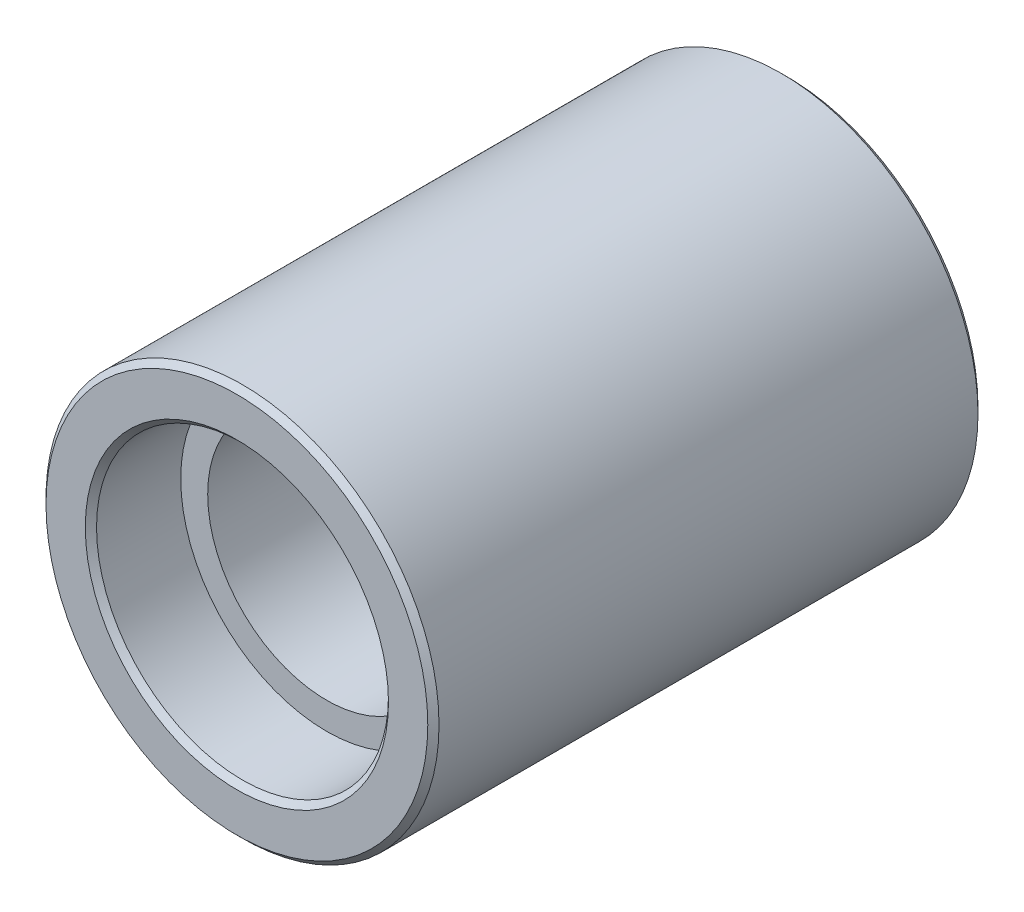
from build123d import *

# Parameters (mm, degrees)
ESQUISSE1_R             = 17.5
BASE_EXTRUSION_DEPTH    = 24.5
ESQUISSE3_R             = 13
ENL_V_MAT_EXTRU_2_DEPTH = 8
ESQUISSE4_R             = 10.6
ENL_V_MAT_EXTRU_3_DEPTH = 55.895354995
ENL_V_START             = -8
ESQUISSE5_R             = 13
ENL_V_MAT_EXTRU_4_DEPTH = 8
CHANFREIN2_SIZE         = 0.5


with BuildPart() as part:
    # Esquisse1 → Base-Extrusion (new, symmetric)
    with BuildSketch(Plane.XY):
        Circle(ESQUISSE1_R)
    extrude(amount=BASE_EXTRUSION_DEPTH, both=True)

    # Esquisse3 → Enl_v. mat.-Extru.2 (cut)
    with BuildSketch(Plane(origin=(0, 0, -24.5), x_dir=(-1, 0, 0), z_dir=(0, 0, -1))):
        Circle(ESQUISSE3_R)
    extrude(amount=-ENL_V_MAT_EXTRU_2_DEPTH, mode=Mode.SUBTRACT)

    # Esquisse4 → Enl_v. mat.-Extru.3 (cut, through all)
    with BuildSketch(Plane(origin=(0, 0, -24.5), x_dir=(-1, 0, 0), z_dir=(0, 0, -1))):
        Circle(ESQUISSE4_R)
    extrude(amount=-ENL_V_MAT_EXTRU_3_DEPTH, mode=Mode.SUBTRACT)

    # Esquisse5 → Enl_v. mat.-Extru.4 (cut)
    with BuildSketch(Plane.XY.offset(24.5).offset(ENL_V_START)):
        with Locations(Location((0, 0, 0), (0, 0, 180))):
            Circle(ESQUISSE5_R)
    extrude(amount=ENL_V_MAT_EXTRU_4_DEPTH, mode=Mode.SUBTRACT)

    # Chanfrein2
    chanfrein2_edges = [part.edges().sort_by_distance(p)[0] for p in [
        (-17.5, 0, -24.5),
        (-17.5, 0, 24.5),
        (13, 0, -24.5),
        (13, 0, 24.5),
    ]]
    chamfer(chanfrein2_edges, length=CHANFREIN2_SIZE)


solid = part.part
